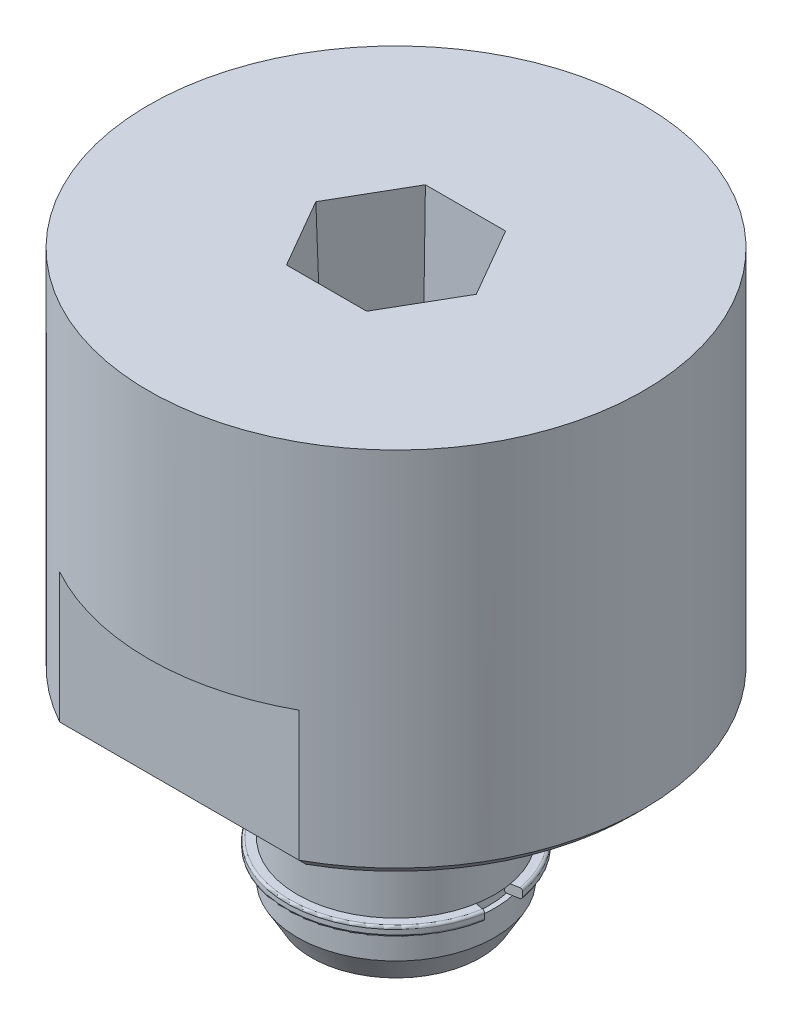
ISO-10303-21;
HEADER;
FILE_DESCRIPTION(('STEP AP214'),'2;1');
FILE_NAME('part.step','',(''),(''),'','','');
FILE_SCHEMA(('AUTOMOTIVE_DESIGN { 1 0 10303 214 1 1 1 1 }'));
ENDSEC;
DATA;
#1=APPLICATION_CONTEXT('core data for automotive mechanical design processes');
#2=APPLICATION_PROTOCOL_DEFINITION('international standard','automotive_design',2000,#1);
#3=PRODUCT_CONTEXT('',#1,'mechanical');
#4=PRODUCT('Part','Part','',(#3));
#5=PRODUCT_RELATED_PRODUCT_CATEGORY('part','',(#4));
#6=PRODUCT_DEFINITION_FORMATION('','',#4);
#7=PRODUCT_DEFINITION_CONTEXT('part definition',#1,'design');
#8=PRODUCT_DEFINITION('design','',#6,#7);
#9=PRODUCT_DEFINITION_SHAPE('','',#8);
#10=(LENGTH_UNIT() NAMED_UNIT(*) SI_UNIT(.MILLI.,.METRE.));
#11=(NAMED_UNIT(*) PLANE_ANGLE_UNIT() SI_UNIT($,.RADIAN.));
#12=(NAMED_UNIT(*) SI_UNIT($,.STERADIAN.) SOLID_ANGLE_UNIT());
#13=UNCERTAINTY_MEASURE_WITH_UNIT(LENGTH_MEASURE(1.E-05),#10,'distance_accuracy_value','');
#14=(GEOMETRIC_REPRESENTATION_CONTEXT(3) GLOBAL_UNCERTAINTY_ASSIGNED_CONTEXT((#13)) GLOBAL_UNIT_ASSIGNED_CONTEXT((#10,
#11,#12)) REPRESENTATION_CONTEXT('',''));
#15=CARTESIAN_POINT('',(0.,0.,0.));
#16=DIRECTION('',(0.,0.,1.));
#17=DIRECTION('',(1.,0.,0.));
#18=AXIS2_PLACEMENT_3D('',#15,#16,#17);
#19=CARTESIAN_POINT('',(0.,0.577599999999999,0.));
#20=DIRECTION('',(0.,-1.,0.));
#21=DIRECTION('',(0.,0.,-1.));
#22=AXIS2_PLACEMENT_3D('',#19,#20,#21);
#23=CYLINDRICAL_SURFACE('',#22,3.0226);
#24=CARTESIAN_POINT('',(0.,1.7714,0.));
#25=DIRECTION('',(0.,-1.,0.));
#26=DIRECTION('',(0.984807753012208,0.,0.17364817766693));
#27=AXIS2_PLACEMENT_3D('',#24,#25,#26);
#28=CIRCLE('',#27,3.0226);
#29=CARTESIAN_POINT('',(2.9766799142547,1.7714,0.524868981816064));
#30=VERTEX_POINT('',#29);
#31=CARTESIAN_POINT('',(2.9766799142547,1.7714,-0.524868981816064));
#32=VERTEX_POINT('',#31);
#33=EDGE_CURVE('E125',#30,#32,#28,.T.);
#34=ORIENTED_EDGE('',*,*,#33,.T.);
#35=DIRECTION('',(0.,1.,0.));
#36=VECTOR('',#35,1.);
#37=CARTESIAN_POINT('',(2.9766799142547,1.7714,-0.524868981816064));
#38=LINE('',#37,#36);
#39=CARTESIAN_POINT('',(2.9766799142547,1.9238,-0.524868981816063));
#40=VERTEX_POINT('',#39);
#41=EDGE_CURVE('E116',#32,#40,#38,.T.);
#42=ORIENTED_EDGE('',*,*,#41,.T.);
#43=CARTESIAN_POINT('',(0.,1.9238,0.));
#44=DIRECTION('',(0.,-1.,0.));
#45=DIRECTION('',(0.984807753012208,0.,0.17364817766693));
#46=AXIS2_PLACEMENT_3D('',#43,#44,#45);
#47=CIRCLE('',#46,3.0226);
#48=CARTESIAN_POINT('',(2.9766799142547,1.9238,0.524868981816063));
#49=VERTEX_POINT('',#48);
#50=EDGE_CURVE('E124',#49,#40,#47,.T.);
#51=ORIENTED_EDGE('',*,*,#50,.F.);
#52=DIRECTION('',(0.,-1.,0.));
#53=VECTOR('',#52,1.);
#54=CARTESIAN_POINT('',(2.9766799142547,1.9238,0.524868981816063));
#55=LINE('',#54,#53);
#56=EDGE_CURVE('E137',#49,#30,#55,.T.);
#57=ORIENTED_EDGE('',*,*,#56,.T.);
#58=EDGE_LOOP('',(#34,#42,#51,#57));
#59=FACE_BOUND('',#58,.T.);
#60=ADVANCED_FACE('F54',(#59),#23,.F.);
#61=CARTESIAN_POINT('',(0.,1.77139999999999,0.));
#62=DIRECTION('',(0.,-1.,0.));
#63=DIRECTION('',(0.,0.,-1.));
#64=AXIS2_PLACEMENT_3D('',#61,#62,#63);
#65=TOROIDAL_SURFACE('',#64,3.0988,0.0761999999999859);
#66=CARTESIAN_POINT('',(0.,1.6952,0.));
#67=DIRECTION('',(0.,-1.,0.));
#68=DIRECTION('',(0.984807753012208,0.,0.173648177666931));
#69=AXIS2_PLACEMENT_3D('',#66,#67,#68);
#70=CIRCLE('',#69,3.0988);
#71=CARTESIAN_POINT('',(3.05172226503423,1.6952,0.538100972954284));
#72=VERTEX_POINT('',#71);
#73=CARTESIAN_POINT('',(3.05172226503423,1.6952,-0.538100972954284));
#74=VERTEX_POINT('',#73);
#75=EDGE_CURVE('E133',#72,#74,#70,.T.);
#76=ORIENTED_EDGE('',*,*,#75,.T.);
#77=CARTESIAN_POINT('',(3.05172226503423,1.77139999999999,-0.538100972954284));
#78=DIRECTION('',(-0.17364817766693,0.,-0.984807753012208));
#79=DIRECTION('',(0.,-1.,0.));
#80=AXIS2_PLACEMENT_3D('',#77,#78,#79);
#81=CIRCLE('',#80,0.0761999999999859);
#82=EDGE_CURVE('E118',#74,#32,#81,.T.);
#83=ORIENTED_EDGE('',*,*,#82,.T.);
#84=ORIENTED_EDGE('',*,*,#33,.F.);
#85=CARTESIAN_POINT('',(3.05172226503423,1.77139999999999,0.538100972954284));
#86=DIRECTION('',(-0.17364817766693,0.,0.984807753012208));
#87=DIRECTION('',(-0.984807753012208,0.,-0.17364817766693));
#88=AXIS2_PLACEMENT_3D('',#85,#86,#87);
#89=CIRCLE('',#88,0.0761999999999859);
#90=EDGE_CURVE('E134',#30,#72,#89,.T.);
#91=ORIENTED_EDGE('',*,*,#90,.T.);
#92=EDGE_LOOP('',(#76,#83,#84,#91));
#93=FACE_BOUND('',#92,.T.);
#94=ADVANCED_FACE('F130',(#93),#65,.T.);
#95=CARTESIAN_POINT('',(3.0988,1.6952,0.));
#96=DIRECTION('',(0.,-1.,0.));
#97=DIRECTION('',(0.,0.,-1.));
#98=AXIS2_PLACEMENT_3D('',#95,#96,#97);
#99=PLANE('',#98);
#100=CARTESIAN_POINT('',(0.,1.6952,0.));
#101=DIRECTION('',(0.,-1.,0.));
#102=DIRECTION('',(0.984807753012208,0.,0.17364817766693));
#103=AXIS2_PLACEMENT_3D('',#100,#101,#102);
#104=CIRCLE('',#103,3.45439999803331);
#105=CARTESIAN_POINT('',(3.40191990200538,1.6952,0.599850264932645));
#106=VERTEX_POINT('',#105);
#107=CARTESIAN_POINT('',(3.40191990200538,1.6952,-0.599850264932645));
#108=VERTEX_POINT('',#107);
#109=EDGE_CURVE('E156',#106,#108,#104,.T.);
#110=ORIENTED_EDGE('',*,*,#109,.T.);
#111=DIRECTION('',(-0.984807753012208,0.,0.17364817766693));
#112=VECTOR('',#111,1.);
#113=CARTESIAN_POINT('',(3.40191990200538,1.6952,-0.599850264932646));
#114=LINE('',#113,#112);
#115=EDGE_CURVE('E161',#108,#74,#114,.T.);
#116=ORIENTED_EDGE('',*,*,#115,.T.);
#117=ORIENTED_EDGE('',*,*,#75,.F.);
#118=DIRECTION('',(0.984807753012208,0.,0.17364817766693));
#119=VECTOR('',#118,1.);
#120=CARTESIAN_POINT('',(3.05172226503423,1.6952,0.538100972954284));
#121=LINE('',#120,#119);
#122=EDGE_CURVE('E165',#72,#106,#121,.T.);
#123=ORIENTED_EDGE('',*,*,#122,.T.);
#124=EDGE_LOOP('',(#110,#116,#117,#123));
#125=FACE_BOUND('',#124,.T.);
#126=ADVANCED_FACE('F248',(#125),#99,.T.);
#127=CARTESIAN_POINT('',(0.,1.77139999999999,0.));
#128=DIRECTION('',(0.,-1.,0.));
#129=DIRECTION('',(0.,0.,-1.));
#130=AXIS2_PLACEMENT_3D('',#127,#128,#129);
#131=TOROIDAL_SURFACE('',#130,3.4544,0.0761999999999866);
#132=CARTESIAN_POINT('',(0.,1.7714,0.));
#133=DIRECTION('',(0.,-1.,0.));
#134=DIRECTION('',(0.984807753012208,0.,0.17364817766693));
#135=AXIS2_PLACEMENT_3D('',#132,#133,#134);
#136=CIRCLE('',#135,3.5306);
#137=CARTESIAN_POINT('',(3.4769622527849,1.7714,0.613082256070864));
#138=VERTEX_POINT('',#137);
#139=CARTESIAN_POINT('',(3.4769622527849,1.7714,-0.613082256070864));
#140=VERTEX_POINT('',#139);
#141=EDGE_CURVE('E170',#138,#140,#136,.T.);
#142=ORIENTED_EDGE('',*,*,#141,.T.);
#143=CARTESIAN_POINT('',(3.40191990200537,1.77139999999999,-0.599850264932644));
#144=DIRECTION('',(-0.17364817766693,0.,-0.984807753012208));
#145=DIRECTION('',(0.984807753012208,0.,-0.17364817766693));
#146=AXIS2_PLACEMENT_3D('',#143,#144,#145);
#147=CIRCLE('',#146,0.0761999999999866);
#148=EDGE_CURVE('E175',#140,#108,#147,.T.);
#149=ORIENTED_EDGE('',*,*,#148,.T.);
#150=ORIENTED_EDGE('',*,*,#109,.F.);
#151=CARTESIAN_POINT('',(3.40191990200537,1.77139999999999,0.599850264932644));
#152=DIRECTION('',(-0.17364817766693,0.,0.984807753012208));
#153=DIRECTION('',(1.10880188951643E-13,-1.,0.));
#154=AXIS2_PLACEMENT_3D('',#151,#152,#153);
#155=CIRCLE('',#154,0.0761999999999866);
#156=EDGE_CURVE('E180',#106,#138,#155,.T.);
#157=ORIENTED_EDGE('',*,*,#156,.T.);
#158=EDGE_LOOP('',(#142,#149,#150,#157));
#159=FACE_BOUND('',#158,.T.);
#160=ADVANCED_FACE('F246',(#159),#131,.T.);
#161=CARTESIAN_POINT('',(0.,0.577599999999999,0.));
#162=DIRECTION('',(0.,-1.,0.));
#163=DIRECTION('',(0.,0.,-1.));
#164=AXIS2_PLACEMENT_3D('',#161,#162,#163);
#165=CYLINDRICAL_SURFACE('',#164,3.5306);
#166=CARTESIAN_POINT('',(0.,1.9238,0.));
#167=DIRECTION('',(0.,-1.,0.));
#168=DIRECTION('',(0.984807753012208,0.,0.17364817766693));
#169=AXIS2_PLACEMENT_3D('',#166,#167,#168);
#170=CIRCLE('',#169,3.5306);
#171=CARTESIAN_POINT('',(3.4769622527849,1.9238,0.613082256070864));
#172=VERTEX_POINT('',#171);
#173=CARTESIAN_POINT('',(3.4769622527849,1.9238,-0.613082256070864));
#174=VERTEX_POINT('',#173);
#175=EDGE_CURVE('E185',#172,#174,#170,.T.);
#176=ORIENTED_EDGE('',*,*,#175,.T.);
#177=DIRECTION('',(0.,-1.,0.));
#178=VECTOR('',#177,1.);
#179=CARTESIAN_POINT('',(3.4769622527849,1.9238,-0.613082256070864));
#180=LINE('',#179,#178);
#181=EDGE_CURVE('E190',#174,#140,#180,.T.);
#182=ORIENTED_EDGE('',*,*,#181,.T.);
#183=ORIENTED_EDGE('',*,*,#141,.F.);
#184=DIRECTION('',(0.,1.,0.));
#185=VECTOR('',#184,1.);
#186=CARTESIAN_POINT('',(3.4769622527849,1.7714,0.613082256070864));
#187=LINE('',#186,#185);
#188=EDGE_CURVE('E195',#138,#172,#187,.T.);
#189=ORIENTED_EDGE('',*,*,#188,.T.);
#190=EDGE_LOOP('',(#176,#182,#183,#189));
#191=FACE_BOUND('',#190,.T.);
#192=ADVANCED_FACE('F242',(#191),#165,.T.);
#193=CARTESIAN_POINT('',(0.,1.92380000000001,0.));
#194=DIRECTION('',(0.,-1.,0.));
#195=DIRECTION('',(0.,0.,-1.));
#196=AXIS2_PLACEMENT_3D('',#193,#194,#195);
#197=TOROIDAL_SURFACE('',#196,3.4544,0.0761999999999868);
#198=CARTESIAN_POINT('',(0.,2.,0.));
#199=DIRECTION('',(0.,-1.,0.));
#200=DIRECTION('',(0.984807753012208,0.,0.17364817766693));
#201=AXIS2_PLACEMENT_3D('',#198,#199,#200);
#202=CIRCLE('',#201,3.45439999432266);
#203=CARTESIAN_POINT('',(3.40191990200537,2.,0.599850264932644));
#204=VERTEX_POINT('',#203);
#205=CARTESIAN_POINT('',(3.40191990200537,2.,-0.599850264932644));
#206=VERTEX_POINT('',#205);
#207=EDGE_CURVE('E200',#204,#206,#202,.T.);
#208=ORIENTED_EDGE('',*,*,#207,.T.);
#209=CARTESIAN_POINT('',(3.40191990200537,1.92380000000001,-0.599850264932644));
#210=DIRECTION('',(-0.17364817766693,0.,-0.984807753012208));
#211=DIRECTION('',(0.,1.,0.));
#212=AXIS2_PLACEMENT_3D('',#209,#210,#211);
#213=CIRCLE('',#212,0.0761999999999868);
#214=EDGE_CURVE('E205',#206,#174,#213,.T.);
#215=ORIENTED_EDGE('',*,*,#214,.T.);
#216=ORIENTED_EDGE('',*,*,#175,.F.);
#217=CARTESIAN_POINT('',(3.40191990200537,1.92380000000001,0.599850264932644));
#218=DIRECTION('',(-0.17364817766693,0.,0.984807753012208));
#219=DIRECTION('',(0.984807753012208,-1.75931010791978E-13,0.17364817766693));
#220=AXIS2_PLACEMENT_3D('',#217,#218,#219);
#221=CIRCLE('',#220,0.0761999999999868);
#222=EDGE_CURVE('E210',#172,#204,#221,.T.);
#223=ORIENTED_EDGE('',*,*,#222,.T.);
#224=EDGE_LOOP('',(#208,#215,#216,#223));
#225=FACE_BOUND('',#224,.T.);
#226=ADVANCED_FACE('F240',(#225),#197,.T.);
#227=CARTESIAN_POINT('',(3.4544,2.,0.));
#228=DIRECTION('',(0.,1.,0.));
#229=DIRECTION('',(0.,0.,1.));
#230=AXIS2_PLACEMENT_3D('',#227,#228,#229);
#231=PLANE('',#230);
#232=CARTESIAN_POINT('',(0.,2.,0.));
#233=DIRECTION('',(0.,-1.,0.));
#234=DIRECTION('',(0.984807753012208,0.,0.17364817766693));
#235=AXIS2_PLACEMENT_3D('',#232,#233,#234);
#236=CIRCLE('',#235,3.09879999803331);
#237=CARTESIAN_POINT('',(3.05172226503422,2.,0.538100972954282));
#238=VERTEX_POINT('',#237);
#239=CARTESIAN_POINT('',(3.05172226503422,2.,-0.538100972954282));
#240=VERTEX_POINT('',#239);
#241=EDGE_CURVE('E215',#238,#240,#236,.T.);
#242=ORIENTED_EDGE('',*,*,#241,.T.);
#243=DIRECTION('',(0.984807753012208,0.,-0.173648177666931));
#244=VECTOR('',#243,1.);
#245=CARTESIAN_POINT('',(3.05172226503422,2.,-0.538100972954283));
#246=LINE('',#245,#244);
#247=EDGE_CURVE('E76',#240,#206,#246,.T.);
#248=ORIENTED_EDGE('',*,*,#247,.T.);
#249=ORIENTED_EDGE('',*,*,#207,.F.);
#250=DIRECTION('',(-0.984807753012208,0.,-0.173648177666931));
#251=VECTOR('',#250,1.);
#252=CARTESIAN_POINT('',(3.40191990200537,2.,0.599850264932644));
#253=LINE('',#252,#251);
#254=EDGE_CURVE('E223',#204,#238,#253,.T.);
#255=ORIENTED_EDGE('',*,*,#254,.T.);
#256=EDGE_LOOP('',(#242,#248,#249,#255));
#257=FACE_BOUND('',#256,.T.);
#258=ADVANCED_FACE('F235',(#257),#231,.T.);
#259=CARTESIAN_POINT('',(0.,1.92380000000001,0.));
#260=DIRECTION('',(0.,-1.,0.));
#261=DIRECTION('',(0.,0.,-1.));
#262=AXIS2_PLACEMENT_3D('',#259,#260,#261);
#263=TOROIDAL_SURFACE('',#262,3.0988,0.0761999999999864);
#264=ORIENTED_EDGE('',*,*,#50,.T.);
#265=CARTESIAN_POINT('',(3.05172226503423,1.92380000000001,-0.538100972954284));
#266=DIRECTION('',(-0.17364817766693,0.,-0.984807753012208));
#267=DIRECTION('',(-0.984807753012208,-1.78662858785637E-13,0.17364817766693));
#268=AXIS2_PLACEMENT_3D('',#265,#266,#267);
#269=CIRCLE('',#268,0.0761999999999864);
#270=EDGE_CURVE('E63',#40,#240,#269,.T.);
#271=ORIENTED_EDGE('',*,*,#270,.T.);
#272=ORIENTED_EDGE('',*,*,#241,.F.);
#273=CARTESIAN_POINT('',(3.05172226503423,1.92380000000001,0.538100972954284));
#274=DIRECTION('',(-0.17364817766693,0.,0.984807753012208));
#275=DIRECTION('',(0.,1.,0.));
#276=AXIS2_PLACEMENT_3D('',#273,#274,#275);
#277=CIRCLE('',#276,0.0761999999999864);
#278=EDGE_CURVE('E12',#238,#49,#277,.T.);
#279=ORIENTED_EDGE('',*,*,#278,.T.);
#280=EDGE_LOOP('',(#264,#271,#272,#279));
#281=FACE_BOUND('',#280,.T.);
#282=ADVANCED_FACE('F233',(#281),#263,.T.);
#283=CARTESIAN_POINT('',(0.,2.1524,0.));
#284=DIRECTION('',(0.17364817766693,0.,-0.984807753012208));
#285=DIRECTION('',(-0.984807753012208,0.,-0.17364817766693));
#286=AXIS2_PLACEMENT_3D('',#283,#284,#285);
#287=PLANE('',#286);
#288=ORIENTED_EDGE('',*,*,#278,.F.);
#289=ORIENTED_EDGE('',*,*,#254,.F.);
#290=ORIENTED_EDGE('',*,*,#222,.F.);
#291=ORIENTED_EDGE('',*,*,#188,.F.);
#292=ORIENTED_EDGE('',*,*,#156,.F.);
#293=ORIENTED_EDGE('',*,*,#122,.F.);
#294=ORIENTED_EDGE('',*,*,#90,.F.);
#295=ORIENTED_EDGE('',*,*,#56,.F.);
#296=EDGE_LOOP('',(#288,#289,#290,#291,#292,#293,#294,#295));
#297=FACE_BOUND('',#296,.T.);
#298=ADVANCED_FACE('F237',(#297),#287,.T.);
#299=CARTESIAN_POINT('',(3.54950319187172,2.1524,-0.6258731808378));
#300=DIRECTION('',(0.17364817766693,0.,0.984807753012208));
#301=DIRECTION('',(0.984807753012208,0.,-0.17364817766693));
#302=AXIS2_PLACEMENT_3D('',#299,#300,#301);
#303=PLANE('',#302);
#304=ORIENTED_EDGE('',*,*,#82,.F.);
#305=ORIENTED_EDGE('',*,*,#115,.F.);
#306=ORIENTED_EDGE('',*,*,#148,.F.);
#307=ORIENTED_EDGE('',*,*,#181,.F.);
#308=ORIENTED_EDGE('',*,*,#214,.F.);
#309=ORIENTED_EDGE('',*,*,#247,.F.);
#310=ORIENTED_EDGE('',*,*,#270,.F.);
#311=ORIENTED_EDGE('',*,*,#41,.F.);
#312=EDGE_LOOP('',(#304,#305,#306,#307,#308,#309,#310,#311));
#313=FACE_BOUND('',#312,.T.);
#314=ADVANCED_FACE('F56',(#313),#303,.T.);
#315=CLOSED_SHELL('',(#60,#94,#126,#160,#192,#226,#258,#282,#298,#314));
#316=MANIFOLD_SOLID_BREP('B2',#315);
#317=CARTESIAN_POINT('',(7.9975,18.5,0.));
#318=DIRECTION('',(0.,1.,0.));
#319=DIRECTION('',(0.,0.,1.));
#320=AXIS2_PLACEMENT_3D('',#317,#318,#319);
#321=PLANE('',#320);
#322=DIRECTION('',(1.,0.,0.));
#323=VECTOR('',#322,1.);
#324=CARTESIAN_POINT('',(7.9975,18.5,-2.24444538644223));
#325=LINE('',#324,#323);
#326=CARTESIAN_POINT('',(1.29583114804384,18.5,-2.24444538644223));
#327=VERTEX_POINT('',#326);
#328=CARTESIAN_POINT('',(-1.29583114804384,18.5,-2.24444538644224));
#329=VERTEX_POINT('',#328);
#330=EDGE_CURVE('E416',#327,#329,#325,.F.);
#331=ORIENTED_EDGE('',*,*,#330,.F.);
#332=DIRECTION('',(0.5,0.,0.866025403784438));
#333=VECTOR('',#332,1.);
#334=CARTESIAN_POINT('',(3.94312172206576,18.5,2.34079639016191));
#335=LINE('',#334,#333);
#336=CARTESIAN_POINT('',(2.59166229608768,18.5,0.));
#337=VERTEX_POINT('',#336);
#338=EDGE_CURVE('E506',#337,#327,#335,.F.);
#339=ORIENTED_EDGE('',*,*,#338,.F.);
#340=DIRECTION('',(-0.5,0.,0.866025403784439));
#341=VECTOR('',#340,1.);
#342=CARTESIAN_POINT('',(3.94312172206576,18.5,-2.34079639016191));
#343=LINE('',#342,#341);
#344=CARTESIAN_POINT('',(1.29583114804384,18.5,2.24444538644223));
#345=VERTEX_POINT('',#344);
#346=EDGE_CURVE('E423',#345,#337,#343,.F.);
#347=ORIENTED_EDGE('',*,*,#346,.F.);
#348=DIRECTION('',(-1.,0.,0.));
#349=VECTOR('',#348,1.);
#350=CARTESIAN_POINT('',(7.9975,18.5,2.24444538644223));
#351=LINE('',#350,#349);
#352=CARTESIAN_POINT('',(-1.29583114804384,18.5,2.24444538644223));
#353=VERTEX_POINT('',#352);
#354=EDGE_CURVE('E421',#353,#345,#351,.F.);
#355=ORIENTED_EDGE('',*,*,#354,.F.);
#356=DIRECTION('',(-0.5,0.,-0.866025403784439));
#357=VECTOR('',#356,1.);
#358=CARTESIAN_POINT('',(0.0556282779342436,18.5,4.58524177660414));
#359=LINE('',#358,#357);
#360=CARTESIAN_POINT('',(-2.59166229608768,18.5,0.));
#361=VERTEX_POINT('',#360);
#362=EDGE_CURVE('E398',#361,#353,#359,.F.);
#363=ORIENTED_EDGE('',*,*,#362,.F.);
#364=DIRECTION('',(0.5,0.,-0.866025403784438));
#365=VECTOR('',#364,1.);
#366=CARTESIAN_POINT('',(0.0556282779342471,18.5,-4.58524177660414));
#367=LINE('',#366,#365);
#368=EDGE_CURVE('E411',#329,#361,#367,.F.);
#369=ORIENTED_EDGE('',*,*,#368,.F.);
#370=EDGE_LOOP('',(#331,#339,#347,#355,#363,#369));
#371=FACE_BOUND('',#370,.T.);
#372=CARTESIAN_POINT('',(0.,18.5,0.));
#373=DIRECTION('',(0.,-1.,0.));
#374=DIRECTION('',(0.,0.,-1.));
#375=AXIS2_PLACEMENT_3D('',#372,#373,#374);
#376=CIRCLE('',#375,7.9975);
#377=CARTESIAN_POINT('',(0.,18.5,-7.9975));
#378=VERTEX_POINT('',#377);
#379=EDGE_CURVE('E580',#378,#378,#376,.T.);
#380=ORIENTED_EDGE('',*,*,#379,.F.);
#381=EDGE_LOOP('',(#380));
#382=FACE_BOUND('',#381,.T.);
#383=ADVANCED_FACE('F350',(#371,#382),#321,.T.);
#384=CARTESIAN_POINT('',(0.,0.,0.));
#385=DIRECTION('',(0.,-1.,0.));
#386=DIRECTION('',(0.,0.,-1.));
#387=AXIS2_PLACEMENT_3D('',#384,#385,#386);
#388=CYLINDRICAL_SURFACE('',#387,7.9975);
#389=DIRECTION('',(0.,-1.,0.));
#390=VECTOR('',#389,1.);
#391=CARTESIAN_POINT('',(3.86781672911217,11.,7.));
#392=LINE('',#391,#390);
#393=CARTESIAN_POINT('',(3.86781672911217,11.,7.));
#394=VERTEX_POINT('',#393);
#395=CARTESIAN_POINT('',(3.86781672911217,6.8,7.));
#396=VERTEX_POINT('',#395);
#397=EDGE_CURVE('E496',#394,#396,#392,.T.);
#398=ORIENTED_EDGE('',*,*,#397,.T.);
#399=CARTESIAN_POINT('',(0.,6.8,0.));
#400=DIRECTION('',(0.,-1.,0.));
#401=DIRECTION('',(0.,0.,-1.));
#402=AXIS2_PLACEMENT_3D('',#399,#400,#401);
#403=CIRCLE('',#402,7.9975);
#404=CARTESIAN_POINT('',(3.86781672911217,6.8,-7.));
#405=VERTEX_POINT('',#404);
#406=EDGE_CURVE('E429',#396,#405,#403,.F.);
#407=ORIENTED_EDGE('',*,*,#406,.T.);
#408=DIRECTION('',(0.,-1.,0.));
#409=VECTOR('',#408,1.);
#410=CARTESIAN_POINT('',(3.86781672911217,11.,-7.));
#411=LINE('',#410,#409);
#412=CARTESIAN_POINT('',(3.86781672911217,11.,-7.));
#413=VERTEX_POINT('',#412);
#414=EDGE_CURVE('E542',#413,#405,#411,.T.);
#415=ORIENTED_EDGE('',*,*,#414,.F.);
#416=CARTESIAN_POINT('',(0.,11.,0.));
#417=DIRECTION('',(0.,-1.,0.));
#418=DIRECTION('',(0.,0.,-1.));
#419=AXIS2_PLACEMENT_3D('',#416,#417,#418);
#420=CIRCLE('',#419,7.9975);
#421=CARTESIAN_POINT('',(-3.86781672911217,11.,-7.));
#422=VERTEX_POINT('',#421);
#423=EDGE_CURVE('E535',#422,#413,#420,.T.);
#424=ORIENTED_EDGE('',*,*,#423,.F.);
#425=DIRECTION('',(0.,-1.,0.));
#426=VECTOR('',#425,1.);
#427=CARTESIAN_POINT('',(-3.86781672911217,11.,-7.));
#428=LINE('',#427,#426);
#429=CARTESIAN_POINT('',(-3.86781672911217,6.8,-7.));
#430=VERTEX_POINT('',#429);
#431=EDGE_CURVE('E543',#422,#430,#428,.T.);
#432=ORIENTED_EDGE('',*,*,#431,.T.);
#433=CARTESIAN_POINT('',(0.,6.8,0.));
#434=DIRECTION('',(0.,-1.,0.));
#435=DIRECTION('',(0.,0.,-1.));
#436=AXIS2_PLACEMENT_3D('',#433,#434,#435);
#437=CIRCLE('',#436,7.9975);
#438=CARTESIAN_POINT('',(-3.86781672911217,6.8,7.));
#439=VERTEX_POINT('',#438);
#440=EDGE_CURVE('E432',#430,#439,#437,.F.);
#441=ORIENTED_EDGE('',*,*,#440,.T.);
#442=DIRECTION('',(0.,-1.,0.));
#443=VECTOR('',#442,1.);
#444=CARTESIAN_POINT('',(-3.86781672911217,11.,7.));
#445=LINE('',#444,#443);
#446=CARTESIAN_POINT('',(-3.86781672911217,11.,7.));
#447=VERTEX_POINT('',#446);
#448=EDGE_CURVE('E549',#447,#439,#445,.T.);
#449=ORIENTED_EDGE('',*,*,#448,.F.);
#450=CARTESIAN_POINT('',(0.,11.,0.));
#451=DIRECTION('',(0.,-1.,0.));
#452=DIRECTION('',(0.,0.,-1.));
#453=AXIS2_PLACEMENT_3D('',#450,#451,#452);
#454=CIRCLE('',#453,7.9975);
#455=EDGE_CURVE('E539',#394,#447,#454,.T.);
#456=ORIENTED_EDGE('',*,*,#455,.F.);
#457=EDGE_LOOP('',(#398,#407,#415,#424,#432,#441,#449,#456));
#458=FACE_BOUND('',#457,.T.);
#459=ORIENTED_EDGE('',*,*,#379,.T.);
#460=EDGE_LOOP('',(#459));
#461=FACE_BOUND('',#460,.T.);
#462=ADVANCED_FACE('F600',(#458,#461),#388,.T.);
#463=CARTESIAN_POINT('',(3.69,6.5,0.));
#464=DIRECTION('',(0.,-1.,0.));
#465=DIRECTION('',(0.,0.,-1.));
#466=AXIS2_PLACEMENT_3D('',#463,#464,#465);
#467=PLANE('',#466);
#468=CARTESIAN_POINT('',(0.,6.5,0.));
#469=DIRECTION('',(0.,-1.,0.));
#470=DIRECTION('',(0.,0.,-1.));
#471=AXIS2_PLACEMENT_3D('',#468,#469,#470);
#472=CIRCLE('',#471,7.6975);
#473=CARTESIAN_POINT('',(-3.78965780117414,6.5,6.7));
#474=VERTEX_POINT('',#473);
#475=CARTESIAN_POINT('',(-3.78965780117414,6.5,-6.7));
#476=VERTEX_POINT('',#475);
#477=EDGE_CURVE('E586',#474,#476,#472,.T.);
#478=ORIENTED_EDGE('',*,*,#477,.T.);
#479=DIRECTION('',(1.,0.,0.));
#480=VECTOR('',#479,1.);
#481=CARTESIAN_POINT('',(3.86781672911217,6.5,-6.7));
#482=LINE('',#481,#480);
#483=CARTESIAN_POINT('',(3.78965780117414,6.5,-6.7));
#484=VERTEX_POINT('',#483);
#485=EDGE_CURVE('E595',#476,#484,#482,.T.);
#486=ORIENTED_EDGE('',*,*,#485,.T.);
#487=CARTESIAN_POINT('',(0.,6.5,0.));
#488=DIRECTION('',(0.,-1.,0.));
#489=DIRECTION('',(0.,0.,-1.));
#490=AXIS2_PLACEMENT_3D('',#487,#488,#489);
#491=CIRCLE('',#490,7.6975);
#492=CARTESIAN_POINT('',(3.78965780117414,6.5,6.7));
#493=VERTEX_POINT('',#492);
#494=EDGE_CURVE('E592',#484,#493,#491,.T.);
#495=ORIENTED_EDGE('',*,*,#494,.T.);
#496=DIRECTION('',(-1.,0.,0.));
#497=VECTOR('',#496,1.);
#498=CARTESIAN_POINT('',(-3.86781672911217,6.5,6.7));
#499=LINE('',#498,#497);
#500=EDGE_CURVE('E589',#493,#474,#499,.T.);
#501=ORIENTED_EDGE('',*,*,#500,.T.);
#502=EDGE_LOOP('',(#478,#486,#495,#501));
#503=FACE_BOUND('',#502,.T.);
#504=CARTESIAN_POINT('',(4.0658639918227,6.5,-4.0658639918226));
#505=DIRECTION('',(0.,-1.,0.));
#506=DIRECTION('',(-0.707106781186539,0.,-0.707106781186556));
#507=AXIS2_PLACEMENT_3D('',#504,#505,#506);
#508=CIRCLE('',#507,0.559016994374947);
#509=CARTESIAN_POINT('',(3.67057928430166,6.5,-4.46114869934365));
#510=VERTEX_POINT('',#509);
#511=EDGE_CURVE('E487',#510,#510,#508,.T.);
#512=ORIENTED_EDGE('',*,*,#511,.F.);
#513=EDGE_LOOP('',(#512));
#514=FACE_BOUND('',#513,.T.);
#515=CARTESIAN_POINT('',(0.,6.5,-5.75));
#516=DIRECTION('',(0.,-1.,0.));
#517=DIRECTION('',(-1.,0.,0.));
#518=AXIS2_PLACEMENT_3D('',#515,#516,#517);
#519=CIRCLE('',#518,0.559016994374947);
#520=CARTESIAN_POINT('',(-0.559016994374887,6.5,-5.75000000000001));
#521=VERTEX_POINT('',#520);
#522=EDGE_CURVE('E771',#521,#521,#519,.T.);
#523=ORIENTED_EDGE('',*,*,#522,.F.);
#524=EDGE_LOOP('',(#523));
#525=FACE_BOUND('',#524,.T.);
#526=CARTESIAN_POINT('',(-4.06586399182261,6.5,-4.06586399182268));
#527=DIRECTION('',(0.,-1.,0.));
#528=DIRECTION('',(-0.707106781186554,0.,0.707106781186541));
#529=AXIS2_PLACEMENT_3D('',#526,#527,#528);
#530=CIRCLE('',#529,0.559016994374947);
#531=CARTESIAN_POINT('',(-4.46114869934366,6.5,-3.67057928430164));
#532=VERTEX_POINT('',#531);
#533=EDGE_CURVE('E774',#532,#532,#530,.T.);
#534=ORIENTED_EDGE('',*,*,#533,.F.);
#535=EDGE_LOOP('',(#534));
#536=FACE_BOUND('',#535,.T.);
#537=CARTESIAN_POINT('',(-5.75,6.5,0.));
#538=DIRECTION('',(0.,-1.,0.));
#539=DIRECTION('',(0.,0.,1.));
#540=AXIS2_PLACEMENT_3D('',#537,#538,#539);
#541=CIRCLE('',#540,0.559016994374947);
#542=CARTESIAN_POINT('',(-5.75,6.5,0.559016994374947));
#543=VERTEX_POINT('',#542);
#544=EDGE_CURVE('E777',#543,#543,#541,.T.);
#545=ORIENTED_EDGE('',*,*,#544,.F.);
#546=EDGE_LOOP('',(#545));
#547=FACE_BOUND('',#546,.T.);
#548=CARTESIAN_POINT('',(-4.06586399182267,6.5,4.06586399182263));
#549=DIRECTION('',(0.,-1.,0.));
#550=DIRECTION('',(0.707106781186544,0.,0.707106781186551));
#551=AXIS2_PLACEMENT_3D('',#548,#549,#550);
#552=CIRCLE('',#551,0.559016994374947);
#553=CARTESIAN_POINT('',(-3.67057928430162,6.5,4.46114869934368));
#554=VERTEX_POINT('',#553);
#555=EDGE_CURVE('E780',#554,#554,#552,.T.);
#556=ORIENTED_EDGE('',*,*,#555,.F.);
#557=EDGE_LOOP('',(#556));
#558=FACE_BOUND('',#557,.T.);
#559=CARTESIAN_POINT('',(0.,6.5,5.75));
#560=DIRECTION('',(0.,-1.,0.));
#561=DIRECTION('',(1.,0.,0.));
#562=AXIS2_PLACEMENT_3D('',#559,#560,#561);
#563=CIRCLE('',#562,0.559016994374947);
#564=CARTESIAN_POINT('',(0.559016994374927,6.5,5.75));
#565=VERTEX_POINT('',#564);
#566=EDGE_CURVE('E783',#565,#565,#563,.T.);
#567=ORIENTED_EDGE('',*,*,#566,.F.);
#568=EDGE_LOOP('',(#567));
#569=FACE_BOUND('',#568,.T.);
#570=CARTESIAN_POINT('',(4.06586399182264,6.5,4.06586399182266));
#571=DIRECTION('',(0.,-1.,0.));
#572=DIRECTION('',(0.707106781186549,0.,-0.707106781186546));
#573=AXIS2_PLACEMENT_3D('',#570,#571,#572);
#574=CIRCLE('',#573,0.559016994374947);
#575=CARTESIAN_POINT('',(4.46114869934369,6.5,3.67057928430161));
#576=VERTEX_POINT('',#575);
#577=EDGE_CURVE('E785',#576,#576,#574,.T.);
#578=ORIENTED_EDGE('',*,*,#577,.F.);
#579=EDGE_LOOP('',(#578));
#580=FACE_BOUND('',#579,.T.);
#581=CARTESIAN_POINT('',(5.75,6.5,0.));
#582=DIRECTION('',(0.,-1.,0.));
#583=DIRECTION('',(0.,0.,-1.));
#584=AXIS2_PLACEMENT_3D('',#581,#582,#583);
#585=CIRCLE('',#584,0.559016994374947);
#586=CARTESIAN_POINT('',(5.75,6.5,-0.559016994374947));
#587=VERTEX_POINT('',#586);
#588=EDGE_CURVE('E505',#587,#587,#585,.T.);
#589=ORIENTED_EDGE('',*,*,#588,.F.);
#590=EDGE_LOOP('',(#589));
#591=FACE_BOUND('',#590,.T.);
#592=CARTESIAN_POINT('',(0.,6.5,0.));
#593=DIRECTION('',(0.,-1.,0.));
#594=DIRECTION('',(0.,0.,-1.));
#595=AXIS2_PLACEMENT_3D('',#592,#593,#594);
#596=CIRCLE('',#595,3.69);
#597=CARTESIAN_POINT('',(0.,6.5,-3.69));
#598=VERTEX_POINT('',#597);
#599=EDGE_CURVE('E577',#598,#598,#596,.T.);
#600=ORIENTED_EDGE('',*,*,#599,.F.);
#601=EDGE_LOOP('',(#600));
#602=FACE_BOUND('',#601,.T.);
#603=ADVANCED_FACE('F628',(#503,#514,#525,#536,#547,#558,#569,#580,#591,#602),#467,.T.);
#604=CARTESIAN_POINT('',(0.,6.,0.));
#605=DIRECTION('',(0.,-1.,0.));
#606=DIRECTION('',(0.,0.,-1.));
#607=AXIS2_PLACEMENT_3D('',#604,#605,#606);
#608=TOROIDAL_SURFACE('',#607,3.69,0.5);
#609=ORIENTED_EDGE('',*,*,#599,.T.);
#610=EDGE_LOOP('',(#609));
#611=FACE_BOUND('',#610,.T.);
#612=CARTESIAN_POINT('',(0.,6.,0.));
#613=DIRECTION('',(0.,-1.,0.));
#614=DIRECTION('',(0.,0.,-1.));
#615=AXIS2_PLACEMENT_3D('',#612,#613,#614);
#616=CIRCLE('',#615,3.19);
#617=CARTESIAN_POINT('',(0.,6.,-3.19));
#618=VERTEX_POINT('',#617);
#619=EDGE_CURVE('E574',#618,#618,#616,.T.);
#620=ORIENTED_EDGE('',*,*,#619,.F.);
#621=EDGE_LOOP('',(#620));
#622=FACE_BOUND('',#621,.T.);
#623=ADVANCED_FACE('F677',(#611,#622),#608,.F.);
#624=CARTESIAN_POINT('',(0.,0.,0.));
#625=DIRECTION('',(0.,-1.,0.));
#626=DIRECTION('',(0.,0.,-1.));
#627=AXIS2_PLACEMENT_3D('',#624,#625,#626);
#628=CYLINDRICAL_SURFACE('',#627,3.19);
#629=ORIENTED_EDGE('',*,*,#619,.T.);
#630=EDGE_LOOP('',(#629));
#631=FACE_BOUND('',#630,.T.);
#632=CARTESIAN_POINT('',(0.,2.,0.));
#633=DIRECTION('',(0.,-1.,0.));
#634=DIRECTION('',(0.,0.,-1.));
#635=AXIS2_PLACEMENT_3D('',#632,#633,#634);
#636=CIRCLE('',#635,3.19);
#637=CARTESIAN_POINT('',(0.,2.,-3.19));
#638=VERTEX_POINT('',#637);
#639=EDGE_CURVE('E571',#638,#638,#636,.T.);
#640=ORIENTED_EDGE('',*,*,#639,.F.);
#641=EDGE_LOOP('',(#640));
#642=FACE_BOUND('',#641,.T.);
#643=ADVANCED_FACE('F680',(#631,#642),#628,.T.);
#644=CARTESIAN_POINT('',(3.0226,2.,0.));
#645=DIRECTION('',(0.,-1.,0.));
#646=DIRECTION('',(0.,0.,-1.));
#647=AXIS2_PLACEMENT_3D('',#644,#645,#646);
#648=PLANE('',#647);
#649=ORIENTED_EDGE('',*,*,#639,.T.);
#650=EDGE_LOOP('',(#649));
#651=FACE_BOUND('',#650,.T.);
#652=CARTESIAN_POINT('',(0.,2.,0.));
#653=DIRECTION('',(0.,-1.,0.));
#654=DIRECTION('',(0.,0.,-1.));
#655=AXIS2_PLACEMENT_3D('',#652,#653,#654);
#656=CIRCLE('',#655,3.0226);
#657=CARTESIAN_POINT('',(0.,2.,-3.0226));
#658=VERTEX_POINT('',#657);
#659=EDGE_CURVE('E568',#658,#658,#656,.T.);
#660=ORIENTED_EDGE('',*,*,#659,.F.);
#661=EDGE_LOOP('',(#660));
#662=FACE_BOUND('',#661,.T.);
#663=ADVANCED_FACE('F684',(#651,#662),#648,.T.);
#664=CARTESIAN_POINT('',(0.,0.,0.));
#665=DIRECTION('',(0.,-1.,0.));
#666=DIRECTION('',(0.,0.,-1.));
#667=AXIS2_PLACEMENT_3D('',#664,#665,#666);
#668=CYLINDRICAL_SURFACE('',#667,3.0226);
#669=ORIENTED_EDGE('',*,*,#659,.T.);
#670=EDGE_LOOP('',(#669));
#671=FACE_BOUND('',#670,.T.);
#672=CARTESIAN_POINT('',(0.,1.619,0.));
#673=DIRECTION('',(0.,-1.,0.));
#674=DIRECTION('',(0.,0.,-1.));
#675=AXIS2_PLACEMENT_3D('',#672,#673,#674);
#676=CIRCLE('',#675,3.0226);
#677=CARTESIAN_POINT('',(0.,1.619,-3.0226));
#678=VERTEX_POINT('',#677);
#679=EDGE_CURVE('E565',#678,#678,#676,.T.);
#680=ORIENTED_EDGE('',*,*,#679,.F.);
#681=EDGE_LOOP('',(#680));
#682=FACE_BOUND('',#681,.T.);
#683=ADVANCED_FACE('F688',(#671,#682),#668,.T.);
#684=CARTESIAN_POINT('',(3.19,1.619,0.));
#685=DIRECTION('',(0.,1.,0.));
#686=DIRECTION('',(0.,0.,1.));
#687=AXIS2_PLACEMENT_3D('',#684,#685,#686);
#688=PLANE('',#687);
#689=ORIENTED_EDGE('',*,*,#679,.T.);
#690=EDGE_LOOP('',(#689));
#691=FACE_BOUND('',#690,.T.);
#692=CARTESIAN_POINT('',(0.,1.619,0.));
#693=DIRECTION('',(0.,-1.,0.));
#694=DIRECTION('',(0.,0.,-1.));
#695=AXIS2_PLACEMENT_3D('',#692,#693,#694);
#696=CIRCLE('',#695,3.19);
#697=CARTESIAN_POINT('',(0.,1.619,-3.19));
#698=VERTEX_POINT('',#697);
#699=EDGE_CURVE('E562',#698,#698,#696,.T.);
#700=ORIENTED_EDGE('',*,*,#699,.F.);
#701=EDGE_LOOP('',(#700));
#702=FACE_BOUND('',#701,.T.);
#703=ADVANCED_FACE('F692',(#691,#702),#688,.T.);
#704=CARTESIAN_POINT('',(0.,0.,0.));
#705=DIRECTION('',(0.,-1.,0.));
#706=DIRECTION('',(0.,0.,-1.));
#707=AXIS2_PLACEMENT_3D('',#704,#705,#706);
#708=CYLINDRICAL_SURFACE('',#707,3.19);
#709=ORIENTED_EDGE('',*,*,#699,.T.);
#710=EDGE_LOOP('',(#709));
#711=FACE_BOUND('',#710,.T.);
#712=CARTESIAN_POINT('',(0.,0.8,0.));
#713=DIRECTION('',(0.,-1.,0.));
#714=DIRECTION('',(0.,0.,-1.));
#715=AXIS2_PLACEMENT_3D('',#712,#713,#714);
#716=CIRCLE('',#715,3.19);
#717=CARTESIAN_POINT('',(0.,0.8,-3.19));
#718=VERTEX_POINT('',#717);
#719=EDGE_CURVE('E559',#718,#718,#716,.T.);
#720=ORIENTED_EDGE('',*,*,#719,.F.);
#721=EDGE_LOOP('',(#720));
#722=FACE_BOUND('',#721,.T.);
#723=ADVANCED_FACE('F696',(#711,#722),#708,.T.);
#724=CARTESIAN_POINT('',(0.,0.,0.));
#725=DIRECTION('',(0.,1.,0.));
#726=DIRECTION('',(0.,0.,1.));
#727=AXIS2_PLACEMENT_3D('',#724,#725,#726);
#728=CONICAL_SURFACE('',#727,2.72811978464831,0.523598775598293);
#729=ORIENTED_EDGE('',*,*,#719,.T.);
#730=EDGE_LOOP('',(#729));
#731=FACE_BOUND('',#730,.T.);
#732=CARTESIAN_POINT('',(0.,0.,0.));
#733=DIRECTION('',(0.,-1.,0.));
#734=DIRECTION('',(0.,0.,-1.));
#735=AXIS2_PLACEMENT_3D('',#732,#733,#734);
#736=CIRCLE('',#735,2.72811978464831);
#737=CARTESIAN_POINT('',(0.,0.,-2.72811978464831));
#738=VERTEX_POINT('',#737);
#739=EDGE_CURVE('E546',#738,#738,#736,.T.);
#740=ORIENTED_EDGE('',*,*,#739,.F.);
#741=EDGE_LOOP('',(#740));
#742=FACE_BOUND('',#741,.T.);
#743=ADVANCED_FACE('F700',(#731,#742),#728,.T.);
#744=CARTESIAN_POINT('',(0.,0.,0.));
#745=DIRECTION('',(0.,-1.,0.));
#746=DIRECTION('',(0.,0.,-1.));
#747=AXIS2_PLACEMENT_3D('',#744,#745,#746);
#748=PLANE('',#747);
#749=CARTESIAN_POINT('',(0.,0.,0.));
#750=DIRECTION('',(0.,-1.,0.));
#751=DIRECTION('',(0.,0.,-1.));
#752=AXIS2_PLACEMENT_3D('',#749,#750,#751);
#753=CIRCLE('',#752,2.25000000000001);
#754=CARTESIAN_POINT('',(0.,0.,-2.25000000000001));
#755=VERTEX_POINT('',#754);
#756=EDGE_CURVE('E360',#755,#755,#753,.F.);
#757=ORIENTED_EDGE('',*,*,#756,.T.);
#758=EDGE_LOOP('',(#757));
#759=FACE_BOUND('',#758,.T.);
#760=ORIENTED_EDGE('',*,*,#739,.T.);
#761=EDGE_LOOP('',(#760));
#762=FACE_BOUND('',#761,.T.);
#763=ADVANCED_FACE('F704',(#759,#762),#748,.T.);
#764=CARTESIAN_POINT('',(-3.86781672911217,11.,7.));
#765=DIRECTION('',(0.,0.,-1.));
#766=DIRECTION('',(-1.,0.,0.));
#767=AXIS2_PLACEMENT_3D('',#764,#765,#766);
#768=PLANE('',#767);
#769=ORIENTED_EDGE('',*,*,#448,.T.);
#770=DIRECTION('',(1.,0.,0.));
#771=VECTOR('',#770,1.);
#772=CARTESIAN_POINT('',(3.86781672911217,6.8,7.));
#773=LINE('',#772,#771);
#774=EDGE_CURVE('E368',#439,#396,#773,.T.);
#775=ORIENTED_EDGE('',*,*,#774,.T.);
#776=ORIENTED_EDGE('',*,*,#397,.F.);
#777=DIRECTION('',(1.,0.,0.));
#778=VECTOR('',#777,1.);
#779=CARTESIAN_POINT('',(-3.86781672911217,11.,7.));
#780=LINE('',#779,#778);
#781=EDGE_CURVE('E551',#447,#394,#780,.T.);
#782=ORIENTED_EDGE('',*,*,#781,.F.);
#783=EDGE_LOOP('',(#769,#775,#776,#782));
#784=FACE_BOUND('',#783,.T.);
#785=ADVANCED_FACE('F611',(#784),#768,.F.);
#786=CARTESIAN_POINT('',(0.,11.,0.));
#787=DIRECTION('',(0.,-1.,0.));
#788=DIRECTION('',(0.,0.,-1.));
#789=AXIS2_PLACEMENT_3D('',#786,#787,#788);
#790=PLANE('',#789);
#791=ORIENTED_EDGE('',*,*,#455,.T.);
#792=ORIENTED_EDGE('',*,*,#781,.T.);
#793=EDGE_LOOP('',(#791,#792));
#794=FACE_BOUND('',#793,.T.);
#795=ADVANCED_FACE('F708',(#794),#790,.T.);
#796=CARTESIAN_POINT('',(-3.86781672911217,11.,-7.));
#797=DIRECTION('',(0.,0.,1.));
#798=DIRECTION('',(1.,0.,0.));
#799=AXIS2_PLACEMENT_3D('',#796,#797,#798);
#800=PLANE('',#799);
#801=ORIENTED_EDGE('',*,*,#414,.T.);
#802=DIRECTION('',(-1.,0.,0.));
#803=VECTOR('',#802,1.);
#804=CARTESIAN_POINT('',(-3.86781672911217,6.8,-7.));
#805=LINE('',#804,#803);
#806=EDGE_CURVE('E583',#405,#430,#805,.T.);
#807=ORIENTED_EDGE('',*,*,#806,.T.);
#808=ORIENTED_EDGE('',*,*,#431,.F.);
#809=DIRECTION('',(-1.,0.,0.));
#810=VECTOR('',#809,1.);
#811=CARTESIAN_POINT('',(-3.86781672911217,11.,-7.));
#812=LINE('',#811,#810);
#813=EDGE_CURVE('E538',#413,#422,#812,.T.);
#814=ORIENTED_EDGE('',*,*,#813,.F.);
#815=EDGE_LOOP('',(#801,#807,#808,#814));
#816=FACE_BOUND('',#815,.T.);
#817=ADVANCED_FACE('F711',(#816),#800,.F.);
#818=CARTESIAN_POINT('',(0.,11.,0.));
#819=DIRECTION('',(0.,-1.,0.));
#820=DIRECTION('',(0.,0.,-1.));
#821=AXIS2_PLACEMENT_3D('',#818,#819,#820);
#822=PLANE('',#821);
#823=ORIENTED_EDGE('',*,*,#423,.T.);
#824=ORIENTED_EDGE('',*,*,#813,.T.);
#825=EDGE_LOOP('',(#823,#824));
#826=FACE_BOUND('',#825,.T.);
#827=ADVANCED_FACE('F717',(#826),#822,.T.);
#828=CARTESIAN_POINT('',(1.15470053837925,11.5,-2.));
#829=DIRECTION('',(0.,0.034899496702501,0.999390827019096));
#830=DIRECTION('',(0.,-0.999390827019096,0.034899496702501));
#831=AXIS2_PLACEMENT_3D('',#828,#829,#830);
#832=PLANE('',#831);
#833=ORIENTED_EDGE('',*,*,#330,.T.);
#834=DIRECTION('',(-0.0201451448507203,0.999188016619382,-0.0348924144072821));
#835=VECTOR('',#834,1.);
#836=CARTESIAN_POINT('',(-1.15376332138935,11.4535145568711,-1.99837669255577));
#837=LINE('',#836,#835);
#838=CARTESIAN_POINT('',(-1.15470053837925,11.5,-2.));
#839=VERTEX_POINT('',#838);
#840=EDGE_CURVE('E407',#839,#329,#837,.T.);
#841=ORIENTED_EDGE('',*,*,#840,.F.);
#842=DIRECTION('',(-1.,0.,0.));
#843=VECTOR('',#842,1.);
#844=CARTESIAN_POINT('',(1.15470053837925,11.5,-2.));
#845=LINE('',#844,#843);
#846=CARTESIAN_POINT('',(1.15470053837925,11.5,-2.));
#847=VERTEX_POINT('',#846);
#848=EDGE_CURVE('E508',#847,#839,#845,.T.);
#849=ORIENTED_EDGE('',*,*,#848,.F.);
#850=DIRECTION('',(0.0201451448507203,0.999188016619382,-0.0348924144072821));
#851=VECTOR('',#850,1.);
#852=CARTESIAN_POINT('',(1.15376332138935,11.4535145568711,-1.99837669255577));
#853=LINE('',#852,#851);
#854=EDGE_CURVE('E495',#847,#327,#853,.T.);
#855=ORIENTED_EDGE('',*,*,#854,.T.);
#856=EDGE_LOOP('',(#833,#841,#849,#855));
#857=FACE_BOUND('',#856,.T.);
#858=ADVANCED_FACE('F649',(#857),#832,.T.);
#859=CARTESIAN_POINT('',(2.3094010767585,11.5,0.));
#860=DIRECTION('',(-0.865497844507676,0.034899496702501,0.499695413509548));
#861=DIRECTION('',(0.5,0.,0.866025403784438));
#862=AXIS2_PLACEMENT_3D('',#859,#860,#861);
#863=PLANE('',#862);
#864=ORIENTED_EDGE('',*,*,#338,.T.);
#865=ORIENTED_EDGE('',*,*,#854,.F.);
#866=DIRECTION('',(-0.5,0.,-0.866025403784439));
#867=VECTOR('',#866,1.);
#868=CARTESIAN_POINT('',(2.3094010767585,11.5,0.));
#869=LINE('',#868,#867);
#870=CARTESIAN_POINT('',(2.3094010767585,11.5,0.));
#871=VERTEX_POINT('',#870);
#872=EDGE_CURVE('E494',#871,#847,#869,.T.);
#873=ORIENTED_EDGE('',*,*,#872,.F.);
#874=DIRECTION('',(0.0402902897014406,0.999188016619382,0.));
#875=VECTOR('',#874,1.);
#876=CARTESIAN_POINT('',(2.3075266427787,11.4535145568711,0.));
#877=LINE('',#876,#875);
#878=EDGE_CURVE('E497',#871,#337,#877,.T.);
#879=ORIENTED_EDGE('',*,*,#878,.T.);
#880=EDGE_LOOP('',(#864,#865,#873,#879));
#881=FACE_BOUND('',#880,.T.);
#882=ADVANCED_FACE('F520',(#881),#863,.T.);
#883=CARTESIAN_POINT('',(1.15470053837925,11.5,2.));
#884=DIRECTION('',(-0.865497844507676,0.034899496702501,-0.499695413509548));
#885=DIRECTION('',(-0.5,0.,0.866025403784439));
#886=AXIS2_PLACEMENT_3D('',#883,#884,#885);
#887=PLANE('',#886);
#888=ORIENTED_EDGE('',*,*,#346,.T.);
#889=ORIENTED_EDGE('',*,*,#878,.F.);
#890=DIRECTION('',(0.5,0.,-0.866025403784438));
#891=VECTOR('',#890,1.);
#892=CARTESIAN_POINT('',(1.15470053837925,11.5,2.));
#893=LINE('',#892,#891);
#894=CARTESIAN_POINT('',(1.15470053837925,11.5,2.));
#895=VERTEX_POINT('',#894);
#896=EDGE_CURVE('E529',#895,#871,#893,.T.);
#897=ORIENTED_EDGE('',*,*,#896,.F.);
#898=DIRECTION('',(0.0201451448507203,0.999188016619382,0.0348924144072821));
#899=VECTOR('',#898,1.);
#900=CARTESIAN_POINT('',(1.15376332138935,11.4535145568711,1.99837669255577));
#901=LINE('',#900,#899);
#902=EDGE_CURVE('E500',#895,#345,#901,.T.);
#903=ORIENTED_EDGE('',*,*,#902,.T.);
#904=EDGE_LOOP('',(#888,#889,#897,#903));
#905=FACE_BOUND('',#904,.T.);
#906=ADVANCED_FACE('F513',(#905),#887,.T.);
#907=CARTESIAN_POINT('',(-1.15470053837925,11.5,2.));
#908=DIRECTION('',(0.,0.034899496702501,-0.999390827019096));
#909=DIRECTION('',(0.,0.999390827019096,0.034899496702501));
#910=AXIS2_PLACEMENT_3D('',#907,#908,#909);
#911=PLANE('',#910);
#912=ORIENTED_EDGE('',*,*,#354,.T.);
#913=ORIENTED_EDGE('',*,*,#902,.F.);
#914=DIRECTION('',(1.,0.,0.));
#915=VECTOR('',#914,1.);
#916=CARTESIAN_POINT('',(-1.15470053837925,11.5,2.));
#917=LINE('',#916,#915);
#918=CARTESIAN_POINT('',(-1.15470053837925,11.5,2.));
#919=VERTEX_POINT('',#918);
#920=EDGE_CURVE('E531',#919,#895,#917,.T.);
#921=ORIENTED_EDGE('',*,*,#920,.F.);
#922=DIRECTION('',(-0.0201451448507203,0.999188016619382,0.0348924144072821));
#923=VECTOR('',#922,1.);
#924=CARTESIAN_POINT('',(-1.15376332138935,11.4535145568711,1.99837669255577));
#925=LINE('',#924,#923);
#926=EDGE_CURVE('E406',#919,#353,#925,.T.);
#927=ORIENTED_EDGE('',*,*,#926,.T.);
#928=EDGE_LOOP('',(#912,#913,#921,#927));
#929=FACE_BOUND('',#928,.T.);
#930=ADVANCED_FACE('F660',(#929),#911,.T.);
#931=CARTESIAN_POINT('',(-2.3094010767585,11.5,0.));
#932=DIRECTION('',(0.865497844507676,0.034899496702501,-0.499695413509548));
#933=DIRECTION('',(-0.5,0.,-0.866025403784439));
#934=AXIS2_PLACEMENT_3D('',#931,#932,#933);
#935=PLANE('',#934);
#936=ORIENTED_EDGE('',*,*,#362,.T.);
#937=ORIENTED_EDGE('',*,*,#926,.F.);
#938=DIRECTION('',(0.5,0.,0.866025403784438));
#939=VECTOR('',#938,1.);
#940=CARTESIAN_POINT('',(-2.3094010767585,11.5,0.));
#941=LINE('',#940,#939);
#942=CARTESIAN_POINT('',(-2.3094010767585,11.5,0.));
#943=VERTEX_POINT('',#942);
#944=EDGE_CURVE('E402',#943,#919,#941,.T.);
#945=ORIENTED_EDGE('',*,*,#944,.F.);
#946=DIRECTION('',(-0.0402902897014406,0.999188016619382,0.));
#947=VECTOR('',#946,1.);
#948=CARTESIAN_POINT('',(-2.3075266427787,11.4535145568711,0.));
#949=LINE('',#948,#947);
#950=EDGE_CURVE('E393',#943,#361,#949,.T.);
#951=ORIENTED_EDGE('',*,*,#950,.T.);
#952=EDGE_LOOP('',(#936,#937,#945,#951));
#953=FACE_BOUND('',#952,.T.);
#954=ADVANCED_FACE('F395',(#953),#935,.T.);
#955=CARTESIAN_POINT('',(-1.15470053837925,11.5,-2.));
#956=DIRECTION('',(0.865497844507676,0.034899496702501,0.499695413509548));
#957=DIRECTION('',(0.5,0.,-0.866025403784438));
#958=AXIS2_PLACEMENT_3D('',#955,#956,#957);
#959=PLANE('',#958);
#960=ORIENTED_EDGE('',*,*,#368,.T.);
#961=ORIENTED_EDGE('',*,*,#950,.F.);
#962=DIRECTION('',(-0.5,0.,0.866025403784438));
#963=VECTOR('',#962,1.);
#964=CARTESIAN_POINT('',(-1.15470053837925,11.5,-2.));
#965=LINE('',#964,#963);
#966=EDGE_CURVE('E650',#839,#943,#965,.T.);
#967=ORIENTED_EDGE('',*,*,#966,.F.);
#968=ORIENTED_EDGE('',*,*,#840,.T.);
#969=EDGE_LOOP('',(#960,#961,#967,#968));
#970=FACE_BOUND('',#969,.T.);
#971=ADVANCED_FACE('F412',(#970),#959,.T.);
#972=CARTESIAN_POINT('',(0.,11.5,0.));
#973=DIRECTION('',(0.,1.,0.));
#974=DIRECTION('',(0.,0.,1.));
#975=AXIS2_PLACEMENT_3D('',#972,#973,#974);
#976=PLANE('',#975);
#977=CARTESIAN_POINT('',(0.,11.5,0.));
#978=DIRECTION('',(0.,1.,0.));
#979=DIRECTION('',(0.,0.,1.));
#980=AXIS2_PLACEMENT_3D('',#977,#978,#979);
#981=CIRCLE('',#980,1.5);
#982=CARTESIAN_POINT('',(0.,11.5,1.5));
#983=VERTEX_POINT('',#982);
#984=EDGE_CURVE('E446',#983,#983,#981,.T.);
#985=ORIENTED_EDGE('',*,*,#984,.F.);
#986=EDGE_LOOP('',(#985));
#987=FACE_BOUND('',#986,.T.);
#988=ORIENTED_EDGE('',*,*,#848,.T.);
#989=ORIENTED_EDGE('',*,*,#966,.T.);
#990=ORIENTED_EDGE('',*,*,#944,.T.);
#991=ORIENTED_EDGE('',*,*,#920,.T.);
#992=ORIENTED_EDGE('',*,*,#896,.T.);
#993=ORIENTED_EDGE('',*,*,#872,.T.);
#994=EDGE_LOOP('',(#988,#989,#990,#991,#992,#993));
#995=FACE_BOUND('',#994,.T.);
#996=ADVANCED_FACE('F652',(#987,#995),#976,.T.);
#997=CARTESIAN_POINT('',(5.75,6.,0.));
#998=DIRECTION('',(0.,-1.,0.));
#999=DIRECTION('',(1.,0.,0.));
#1000=AXIS2_PLACEMENT_3D('',#997,#998,#999);
#1001=SPHERICAL_SURFACE('',#1000,0.75);
#1002=ORIENTED_EDGE('',*,*,#588,.T.);
#1003=EDGE_LOOP('',(#1002));
#1004=FACE_BOUND('',#1003,.T.);
#1005=ADVANCED_FACE('F724',(#1004),#1001,.F.);
#1006=CARTESIAN_POINT('',(4.06586399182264,6.,4.06586399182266));
#1007=DIRECTION('',(0.,-1.,0.));
#1008=DIRECTION('',(0.707106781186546,0.,0.707106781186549));
#1009=AXIS2_PLACEMENT_3D('',#1006,#1007,#1008);
#1010=SPHERICAL_SURFACE('',#1009,0.75);
#1011=ORIENTED_EDGE('',*,*,#577,.T.);
#1012=EDGE_LOOP('',(#1011));
#1013=FACE_BOUND('',#1012,.T.);
#1014=ADVANCED_FACE('F728',(#1013),#1010,.F.);
#1015=CARTESIAN_POINT('',(0.,6.,5.75));
#1016=DIRECTION('',(0.,-1.,0.));
#1017=DIRECTION('',(0.,0.,1.));
#1018=AXIS2_PLACEMENT_3D('',#1015,#1016,#1017);
#1019=SPHERICAL_SURFACE('',#1018,0.75);
#1020=ORIENTED_EDGE('',*,*,#566,.T.);
#1021=EDGE_LOOP('',(#1020));
#1022=FACE_BOUND('',#1021,.T.);
#1023=ADVANCED_FACE('F732',(#1022),#1019,.F.);
#1024=CARTESIAN_POINT('',(-4.06586399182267,6.,4.06586399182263));
#1025=DIRECTION('',(0.,-1.,0.));
#1026=DIRECTION('',(-0.707106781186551,0.,0.707106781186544));
#1027=AXIS2_PLACEMENT_3D('',#1024,#1025,#1026);
#1028=SPHERICAL_SURFACE('',#1027,0.75);
#1029=ORIENTED_EDGE('',*,*,#555,.T.);
#1030=EDGE_LOOP('',(#1029));
#1031=FACE_BOUND('',#1030,.T.);
#1032=ADVANCED_FACE('F736',(#1031),#1028,.F.);
#1033=CARTESIAN_POINT('',(-5.75,6.,0.));
#1034=DIRECTION('',(0.,-1.,0.));
#1035=DIRECTION('',(-1.,0.,0.));
#1036=AXIS2_PLACEMENT_3D('',#1033,#1034,#1035);
#1037=SPHERICAL_SURFACE('',#1036,0.75);
#1038=ORIENTED_EDGE('',*,*,#544,.T.);
#1039=EDGE_LOOP('',(#1038));
#1040=FACE_BOUND('',#1039,.T.);
#1041=ADVANCED_FACE('F740',(#1040),#1037,.F.);
#1042=CARTESIAN_POINT('',(-4.06586399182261,6.,-4.06586399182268));
#1043=DIRECTION('',(0.,-1.,0.));
#1044=DIRECTION('',(-0.707106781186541,0.,-0.707106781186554));
#1045=AXIS2_PLACEMENT_3D('',#1042,#1043,#1044);
#1046=SPHERICAL_SURFACE('',#1045,0.75);
#1047=ORIENTED_EDGE('',*,*,#533,.T.);
#1048=EDGE_LOOP('',(#1047));
#1049=FACE_BOUND('',#1048,.T.);
#1050=ADVANCED_FACE('F744',(#1049),#1046,.F.);
#1051=CARTESIAN_POINT('',(0.,6.,-5.75));
#1052=DIRECTION('',(0.,-1.,0.));
#1053=DIRECTION('',(0.,0.,-1.));
#1054=AXIS2_PLACEMENT_3D('',#1051,#1052,#1053);
#1055=SPHERICAL_SURFACE('',#1054,0.75);
#1056=ORIENTED_EDGE('',*,*,#522,.T.);
#1057=EDGE_LOOP('',(#1056));
#1058=FACE_BOUND('',#1057,.T.);
#1059=ADVANCED_FACE('F748',(#1058),#1055,.F.);
#1060=CARTESIAN_POINT('',(4.0658639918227,6.,-4.0658639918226));
#1061=DIRECTION('',(0.,-1.,0.));
#1062=DIRECTION('',(0.707106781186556,0.,-0.707106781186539));
#1063=AXIS2_PLACEMENT_3D('',#1060,#1061,#1062);
#1064=SPHERICAL_SURFACE('',#1063,0.75);
#1065=ORIENTED_EDGE('',*,*,#511,.T.);
#1066=EDGE_LOOP('',(#1065));
#1067=FACE_BOUND('',#1066,.T.);
#1068=ADVANCED_FACE('F752',(#1067),#1064,.F.);
#1069=CARTESIAN_POINT('',(-3.86781672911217,6.8,7.));
#1070=DIRECTION('',(0.,-0.707106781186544,0.707106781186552));
#1071=DIRECTION('',(-1.,0.,0.));
#1072=AXIS2_PLACEMENT_3D('',#1069,#1070,#1071);
#1073=PLANE('',#1072);
#1074=CARTESIAN_POINT('',(-3.78965780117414,6.5,6.7));
#1075=CARTESIAN_POINT('',(-3.80281288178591,6.54998324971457,6.74998324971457));
#1076=CARTESIAN_POINT('',(-3.81590366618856,6.5999748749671,6.7999748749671));
#1077=CARTESIAN_POINT('',(-3.84195664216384,6.69997487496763,6.89997487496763));
#1078=CARTESIAN_POINT('',(-3.85491883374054,6.7499832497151,6.9499832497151));
#1079=CARTESIAN_POINT('',(-3.86781672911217,6.8,7.));
#1080=B_SPLINE_CURVE_WITH_KNOTS('',3,(#1074,#1075,#1076,#1077,#1078,#1079),.UNSPECIFIED.,.F.,
.F.,(4,2,4),(0.,0.215701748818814,0.431403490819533),.UNSPECIFIED.);
#1081=EDGE_CURVE('E488',#474,#439,#1080,.T.);
#1082=ORIENTED_EDGE('',*,*,#1081,.F.);
#1083=ORIENTED_EDGE('',*,*,#500,.F.);
#1084=CARTESIAN_POINT('',(3.78965780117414,6.5,6.7));
#1085=CARTESIAN_POINT('',(3.80281288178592,6.54998324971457,6.74998324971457));
#1086=CARTESIAN_POINT('',(3.81590366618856,6.5999748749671,6.7999748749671));
#1087=CARTESIAN_POINT('',(3.84195664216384,6.69997487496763,6.89997487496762));
#1088=CARTESIAN_POINT('',(3.85491883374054,6.7499832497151,6.9499832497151));
#1089=CARTESIAN_POINT('',(3.86781672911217,6.8,7.));
#1090=B_SPLINE_CURVE_WITH_KNOTS('',3,(#1084,#1085,#1086,#1087,#1088,#1089),.UNSPECIFIED.,.F.,
.F.,(4,2,4),(0.,0.215701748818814,0.431403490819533),.UNSPECIFIED.);
#1091=EDGE_CURVE('E480',#396,#493,#1090,.F.);
#1092=ORIENTED_EDGE('',*,*,#1091,.F.);
#1093=ORIENTED_EDGE('',*,*,#774,.F.);
#1094=EDGE_LOOP('',(#1082,#1083,#1092,#1093));
#1095=FACE_BOUND('',#1094,.T.);
#1096=ADVANCED_FACE('F474',(#1095),#1073,.T.);
#1097=CARTESIAN_POINT('',(0.,6.5,0.));
#1098=DIRECTION('',(0.,1.,0.));
#1099=DIRECTION('',(0.,0.,1.));
#1100=AXIS2_PLACEMENT_3D('',#1097,#1098,#1099);
#1101=CONICAL_SURFACE('',#1100,7.6975,0.785398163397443);
#1102=ORIENTED_EDGE('',*,*,#1091,.T.);
#1103=ORIENTED_EDGE('',*,*,#494,.F.);
#1104=CARTESIAN_POINT('',(3.78965780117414,6.5,-6.7));
#1105=CARTESIAN_POINT('',(3.80281288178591,6.54998324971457,-6.74998324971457));
#1106=CARTESIAN_POINT('',(3.81590366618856,6.5999748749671,-6.7999748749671));
#1107=CARTESIAN_POINT('',(3.84195664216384,6.69997487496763,-6.89997487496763));
#1108=CARTESIAN_POINT('',(3.85491883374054,6.7499832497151,-6.9499832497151));
#1109=CARTESIAN_POINT('',(3.86781672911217,6.8,-7.));
#1110=B_SPLINE_CURVE_WITH_KNOTS('',3,(#1104,#1105,#1106,#1107,#1108,#1109),.UNSPECIFIED.,.F.,
.F.,(4,2,4),(0.,0.215701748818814,0.431403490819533),.UNSPECIFIED.);
#1111=EDGE_CURVE('E445',#405,#484,#1110,.F.);
#1112=ORIENTED_EDGE('',*,*,#1111,.F.);
#1113=ORIENTED_EDGE('',*,*,#406,.F.);
#1114=EDGE_LOOP('',(#1102,#1103,#1112,#1113));
#1115=FACE_BOUND('',#1114,.T.);
#1116=ADVANCED_FACE('F466',(#1115),#1101,.T.);
#1117=CARTESIAN_POINT('',(0.,6.5,0.));
#1118=DIRECTION('',(0.,1.,0.));
#1119=DIRECTION('',(0.,0.,1.));
#1120=AXIS2_PLACEMENT_3D('',#1117,#1118,#1119);
#1121=CONICAL_SURFACE('',#1120,7.6975,0.785398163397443);
#1122=ORIENTED_EDGE('',*,*,#1081,.T.);
#1123=ORIENTED_EDGE('',*,*,#440,.F.);
#1124=CARTESIAN_POINT('',(-3.86781672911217,6.8,-7.));
#1125=CARTESIAN_POINT('',(-3.85491883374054,6.7499832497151,-6.9499832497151));
#1126=CARTESIAN_POINT('',(-3.84195664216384,6.69997487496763,-6.89997487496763));
#1127=CARTESIAN_POINT('',(-3.81590366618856,6.5999748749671,-6.7999748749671));
#1128=CARTESIAN_POINT('',(-3.80281288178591,6.54998324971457,-6.74998324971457));
#1129=CARTESIAN_POINT('',(-3.78965780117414,6.5,-6.7));
#1130=B_SPLINE_CURVE_WITH_KNOTS('',3,(#1124,#1125,#1126,#1127,#1128,#1129),.UNSPECIFIED.,.F.,
.F.,(4,2,4),(0.,0.215701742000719,0.431403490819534),.UNSPECIFIED.);
#1131=EDGE_CURVE('E436',#476,#430,#1130,.F.);
#1132=ORIENTED_EDGE('',*,*,#1131,.F.);
#1133=ORIENTED_EDGE('',*,*,#477,.F.);
#1134=EDGE_LOOP('',(#1122,#1123,#1132,#1133));
#1135=FACE_BOUND('',#1134,.T.);
#1136=ADVANCED_FACE('F454',(#1135),#1121,.T.);
#1137=CARTESIAN_POINT('',(-3.86781672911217,6.8,-7.));
#1138=DIRECTION('',(0.,-0.707106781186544,-0.707106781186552));
#1139=DIRECTION('',(1.,0.,0.));
#1140=AXIS2_PLACEMENT_3D('',#1137,#1138,#1139);
#1141=PLANE('',#1140);
#1142=ORIENTED_EDGE('',*,*,#1111,.T.);
#1143=ORIENTED_EDGE('',*,*,#485,.F.);
#1144=ORIENTED_EDGE('',*,*,#1131,.T.);
#1145=ORIENTED_EDGE('',*,*,#806,.F.);
#1146=EDGE_LOOP('',(#1142,#1143,#1144,#1145));
#1147=FACE_BOUND('',#1146,.T.);
#1148=ADVANCED_FACE('F458',(#1147),#1141,.T.);
#1149=CARTESIAN_POINT('',(0.,0.,0.));
#1150=DIRECTION('',(0.,1.,0.));
#1151=DIRECTION('',(0.,0.,1.));
#1152=AXIS2_PLACEMENT_3D('',#1149,#1150,#1151);
#1153=CYLINDRICAL_SURFACE('',#1152,1.5);
#1154=CARTESIAN_POINT('',(0.,0.750000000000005,0.));
#1155=DIRECTION('',(0.,-1.,0.));
#1156=DIRECTION('',(0.,0.,-1.));
#1157=AXIS2_PLACEMENT_3D('',#1154,#1155,#1156);
#1158=CIRCLE('',#1157,1.5);
#1159=CARTESIAN_POINT('',(0.,0.750000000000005,-1.5));
#1160=VERTEX_POINT('',#1159);
#1161=EDGE_CURVE('E52',#1160,#1160,#1158,.T.);
#1162=ORIENTED_EDGE('',*,*,#1161,.T.);
#1163=EDGE_LOOP('',(#1162));
#1164=FACE_BOUND('',#1163,.T.);
#1165=ORIENTED_EDGE('',*,*,#984,.T.);
#1166=EDGE_LOOP('',(#1165));
#1167=FACE_BOUND('',#1166,.T.);
#1168=ADVANCED_FACE('F464',(#1164,#1167),#1153,.F.);
#1169=CARTESIAN_POINT('',(0.,0.,0.));
#1170=DIRECTION('',(0.,-1.,0.));
#1171=DIRECTION('',(0.,0.,-1.));
#1172=AXIS2_PLACEMENT_3D('',#1169,#1170,#1171);
#1173=CONICAL_SURFACE('',#1172,2.25000000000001,0.785398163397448);
#1174=ORIENTED_EDGE('',*,*,#1161,.F.);
#1175=EDGE_LOOP('',(#1174));
#1176=FACE_BOUND('',#1175,.T.);
#1177=ORIENTED_EDGE('',*,*,#756,.F.);
#1178=EDGE_LOOP('',(#1177));
#1179=FACE_BOUND('',#1178,.T.);
#1180=ADVANCED_FACE('F353',(#1176,#1179),#1173,.F.);
#1181=CLOSED_SHELL('',(#383,#462,#603,#623,#643,#663,#683,#703,#723,#743,#763,#785,#795,#817,
#827,#858,#882,#906,#930,#954,#971,#996,#1005,#1014,#1023,#1032,#1041,#1050,#1059,#1068,#1096,
#1116,#1136,#1148,#1168,#1180));
#1182=MANIFOLD_SOLID_BREP('B6',#1181);
#1183=ADVANCED_BREP_SHAPE_REPRESENTATION('',(#18,#316,#1182),#14);
#1184=SHAPE_DEFINITION_REPRESENTATION(#9,#1183);
ENDSEC;
END-ISO-10303-21;
